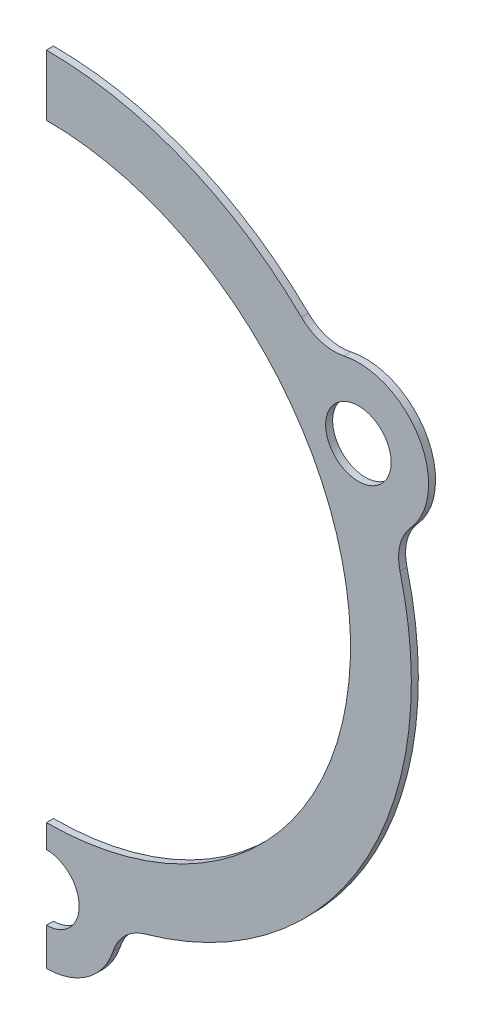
from build123d import *

# Parameters (mm, degrees)
ESQUISSE1_R                  = 65
BASE_EXTRUSION_DEPTH         = 1.5
ESQUISSE2_R                  = 7
ENL_V_MAT_EXTRU_1_DEPTH      = 124.038687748
R_P_TITION_CIRCULAIRE1_COUNT = 3
ESQUISSE3_W                  = 90
ESQUISSE3_H                  = 180
ENL_V_MAT_EXTRU_2_DEPTH      = 124.038687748


with BuildPart() as part:
    # Esquisse1 → Base-Extrusion (new body)
    with BuildSketch(Plane.XY):
        with BuildLine():
            ThreePointArc((21.074015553, -75.099173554), (67.549981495, -39), (75.574799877, 19.298953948))
            ThreePointArc((75.574799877, 19.298953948), (75.554003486, 24.164488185), (77.831908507, 28.463907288))
            ThreePointArc((77.831908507, 28.463907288), (79.674337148, 46), (63.566421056, 53.172456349))
            ThreePointArc((63.566421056, 53.172456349), (58.704062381, 53.349442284), (54.500784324, 55.800219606))
            ThreePointArc((54.500784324, 55.800219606), (0, 78), (-54.500784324, 55.800219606))
            ThreePointArc((-54.500784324, 55.800219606), (-58.704062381, 53.349442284), (-63.566421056, 53.172456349))
            ThreePointArc((-63.566421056, 53.172456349), (-79.674337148, 46), (-77.831908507, 28.463907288))
            ThreePointArc((-77.831908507, 28.463907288), (-75.554003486, 24.164488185), (-75.574799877, 19.298953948))
            ThreePointArc((-75.574799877, 19.298953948), (-67.549981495, -39), (-21.074015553, -75.099173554))
            ThreePointArc((-21.074015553, -75.099173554), (-16.849941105, -77.513930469), (-14.265487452, -81.636363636))
            ThreePointArc((-14.265487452, -81.636363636), (0, -92), (14.265487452, -81.636363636))
            ThreePointArc((14.265487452, -81.636363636), (16.849941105, -77.513930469), (21.074015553, -75.099173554))
        make_face()
        Circle(ESQUISSE1_R, mode=Mode.SUBTRACT)
    extrude(amount=BASE_EXTRUSION_DEPTH)

    # Esquisse2 → Enl_v. mat.-Extru.1 (cut, through all)
    with BuildSketch(Plane.XY.offset(1.5)):
        with Locations((0, -77)):
            Circle(ESQUISSE2_R)
    enl_v_mat_extru_1 = extrude(amount=-ENL_V_MAT_EXTRU_1_DEPTH, mode=Mode.SUBTRACT)

    # R_p_tition circulaire1: Enl_v. mat.-Extru.1 ×3 about axis
    r_p_tition_circulaire1_axis = Axis((0, 0, 51.5), (0, 0, -1))
    for i in range(1, R_P_TITION_CIRCULAIRE1_COUNT):
        add(enl_v_mat_extru_1.rotate(r_p_tition_circulaire1_axis, i * 360 / R_P_TITION_CIRCULAIRE1_COUNT), mode=Mode.SUBTRACT)

    # Esquisse3 → Enl_v. mat.-Extru.2 (cut, through all)
    with BuildSketch(Plane.XY.offset(1.5)):
        with Locations((-45, -10)):
            Rectangle(ESQUISSE3_W, ESQUISSE3_H)
    extrude(amount=-ENL_V_MAT_EXTRU_2_DEPTH, mode=Mode.SUBTRACT)


solid = part.part
